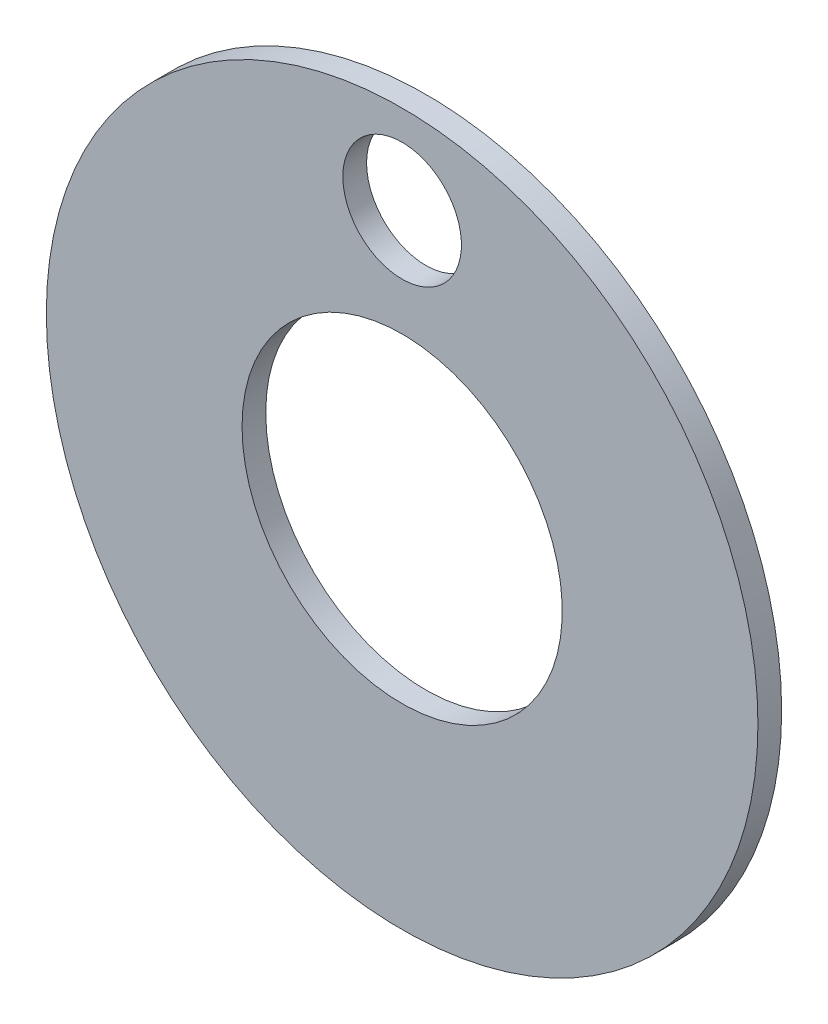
from build123d import *

# Parameters (mm, degrees)
ESQUISSE1_R        = 15
ESQUISSE1_R_2      = 6.75
ESQUISSE1_R_3      = 2.5
BOSS_EXTRU_1_DEPTH = 1


with BuildPart() as part:
    # Esquisse1 → Boss.-Extru.1 (new body)
    with BuildSketch(Plane.XY.offset(0.5)):
        with Locations(Location((0, 0, 0), (0, 0, 180))):
            Circle(ESQUISSE1_R)
        with Locations(Location((0, 0, 0), (0, 0, 180))):
            Circle(ESQUISSE1_R_2, mode=Mode.SUBTRACT)
        with Locations(Location((0, 11.25, 0), (0, 0, 180))):
            Circle(ESQUISSE1_R_3, mode=Mode.SUBTRACT)
    extrude(amount=-BOSS_EXTRU_1_DEPTH)


solid = part.part
